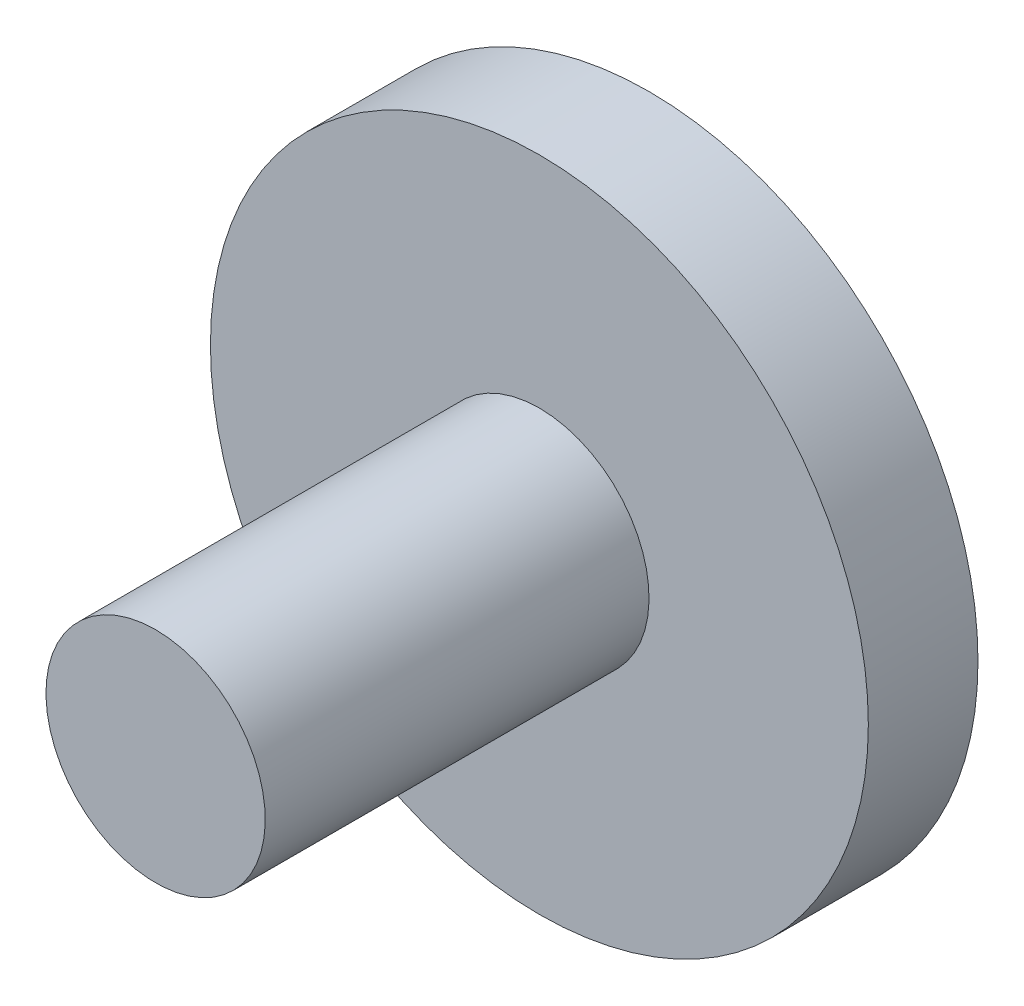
from build123d import *


with BuildPart() as part:
    # Sketch1 → Revolve1 (revolve)
    with BuildSketch(Plane(origin=(0, 0, 0), x_dir=(0, 0, -1), z_dir=(1, 0, 0))):
        Polygon((0, 0), (0, 10), (35, 10), (35, 30), (45, 30), (45, 0), align=None)
    revolve(axis=Axis((0, 0, -45), (0, 0, 1)))


solid = part.part
